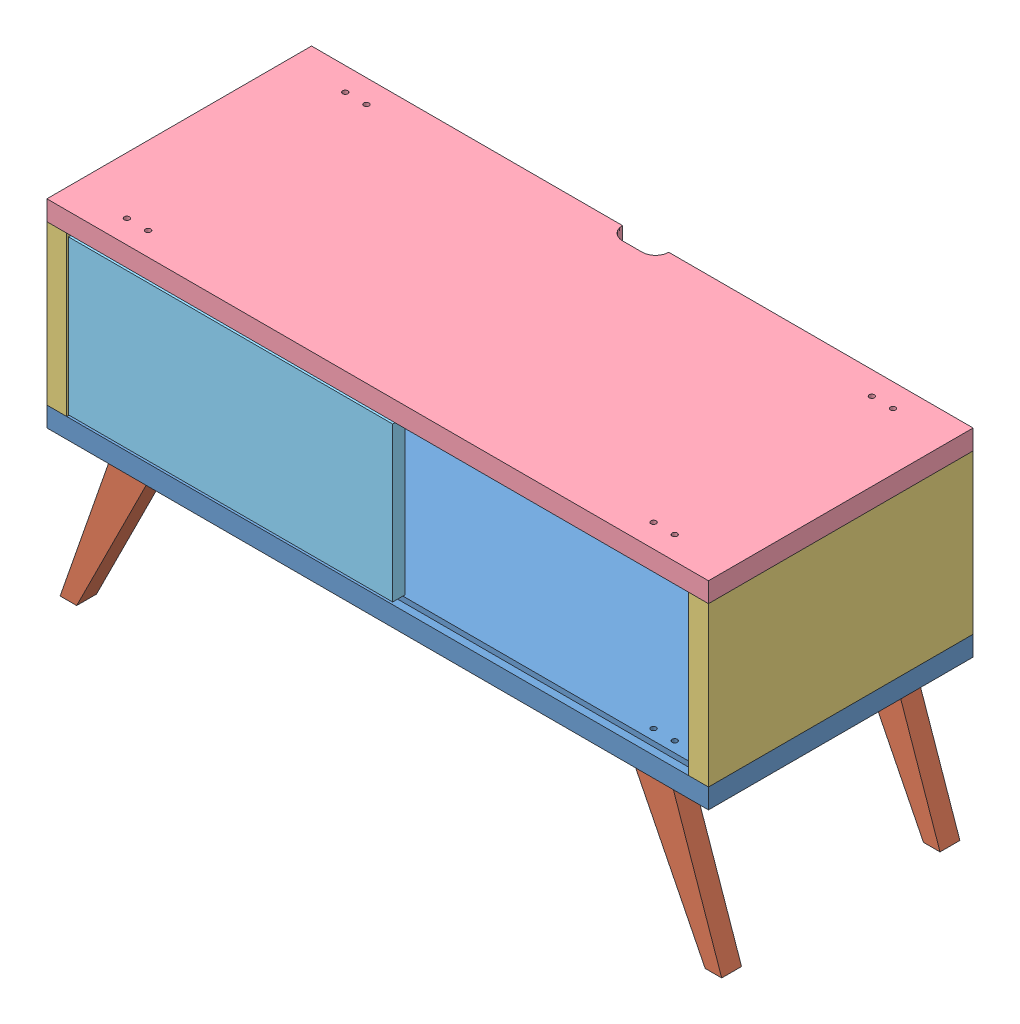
SolidWorks assembly Caisson.SLDASM, configuration Default (file format 15000). Lengths in mm.
Overall size (1000 530 400).
9 component instances, 5 part files, 17 mates.
Components (placement in the parent):
- Dessous Caisson-1: Dessous Caisson.SLDPRT [Défaut] at origin size (1000 30 400)
- Pied Caisson-1: Pied Caisson.SLDPRT [Défaut] at (-500 -230 165) size (140 230 30)
- Pied Caisson-2: Pied Caisson.SLDPRT [Défaut] at (-500 -230 -165) size (140 230 30)
- Pied Caisson-3: Pied Caisson.SLDPRT [Défaut] at (500 -230 165) x (-1 0 0) z (0 0 -1) size (140 230 30)
- Pied Caisson-4: Pied Caisson.SLDPRT [Défaut] at (500 -230 -165) x (-1 0 0) z (0 0 -1) size (140 230 30)
- Coté Caisson-1: Coté Caisson.SLDPRT [Défaut] at (-485 150 0) size (30 240 400)
- Dessus Caisson-1: Dessus Caisson.SLDPRT [Défaut] at (0 300 0) x (-1 0 0) z (0 0 1) size (1000 30 400)
- Coté Caisson-2: Coté Caisson.SLDPRT [Défaut] at (485 150 0) x (-1 0 0) z (0 0 -1) size (30 240 400)
- Porte-1: Porte.SLDPRT [Défaut] at (-222.3722 150 181) size (490 233 19)
Mates (geometry in assembly coordinates):
- Coïncidente1: coincident anti-aligned: plane of Dessous Caisson-1 through (0 0 0) normal (0 -1 0); plane of Pied Caisson-1 through (-420 0 180) normal (0 1 0)
- Coaxiale1: concentric aligned: cylinder of Dessous Caisson-1 through (-414 0 165) axis (0 1 0) radius 4; cylinder of Pied Caisson-1 through (-414 -25 165) axis (0 1 0) radius 2.5
- Coaxiale2: concentric aligned: cylinder of Dessous Caisson-1 through (-382 0 165) axis (0 1 0) radius 4; cylinder of Pied Caisson-1 through (-382 -25 165) axis (0 1 0) radius 2.5
- Coïncidente2: coincident aligned: plane of Pied Caisson-1 through (-420 0 180) normal (0 1 0); plane of Pied Caisson-2 through (-420 0 -150) normal (0 1 0)
- Coaxiale4: concentric aligned: cylinder of Dessous Caisson-1 through (-382 0 -165) axis (0 1 0) radius 4; cylinder of Pied Caisson-2 through (-382 -25 -165) axis (0 1 0) radius 2.5
- Coaxiale5: concentric aligned: cylinder of Dessous Caisson-1 through (-414 0 -165) axis (0 1 0) radius 4; cylinder of Pied Caisson-2 through (-414 -25 -165) axis (0 1 0) radius 2.5
- Coïncidente4: coincident anti-aligned: plane of Dessous Caisson-1 through (0 30 0) normal (0 1 0); plane of Coté Caisson-1 through (-470 30 200) normal (0 -1 0)
- Coïncidente5: coincident aligned: plane of Dessous Caisson-1 through (-500 30 200) normal (-1 0 0); plane of Coté Caisson-1 through (-500 150 0) normal (-1 0 0)
- Coïncidente6: coincident aligned: plane of Dessous Caisson-1 through (-500 30 200) normal (0 0 1); plane of Coté Caisson-1 through (-470 30 200) normal (0 0 1)
- Coïncidente9: coincident aligned: plane of Dessous Caisson-1 through (-500 30 200) normal (0 0 1); plane of Dessus Caisson-1 through (500 270 200) normal (0 0 1)
- Coïncidente10: coincident anti-aligned: plane of Coté Caisson-1 through (-470 270 200) normal (0 1 0); plane of Dessus Caisson-1 through (0 270 0) normal (0 -1 0)
- Coïncidente11: coincident aligned: plane of Dessous Caisson-1 through (-500 30 200) normal (-1 0 0); plane of Dessus Caisson-1 through (-500 270 200) normal (-1 0 0)
- Coïncidente12: coincident anti-aligned: plane of Dessous Caisson-1 through (0 30 0) normal (0 1 0); plane of Coté Caisson-2 through (470 30 -200) normal (0 -1 0)
- Coïncidente13: coincident aligned: plane of Dessous Caisson-1 through (-500 30 200) normal (0 0 1); plane of Coté Caisson-2 through (470 30 200) normal (0 0 1)
- Coïncidente14: coincident aligned: plane of Dessous Caisson-1 through (500 30 200) normal (1 0 0); plane of Coté Caisson-2 through (500 150 0) normal (1 0 0)
- Coïncidente15: coincident aligned: plane of Coté Caisson-1 through (-470 30 200) normal (0 0 1); plane of Porte-1 through (-222.3722 150 200) normal (0 0 1)
- Distance1: distance = 3.5 mm anti-aligned: plane of Porte-1 through (-467.3722 266.5 200) normal (0 1 0); plane of Dessus Caisson-1 through (0 270 0) normal (0 -1 0)
